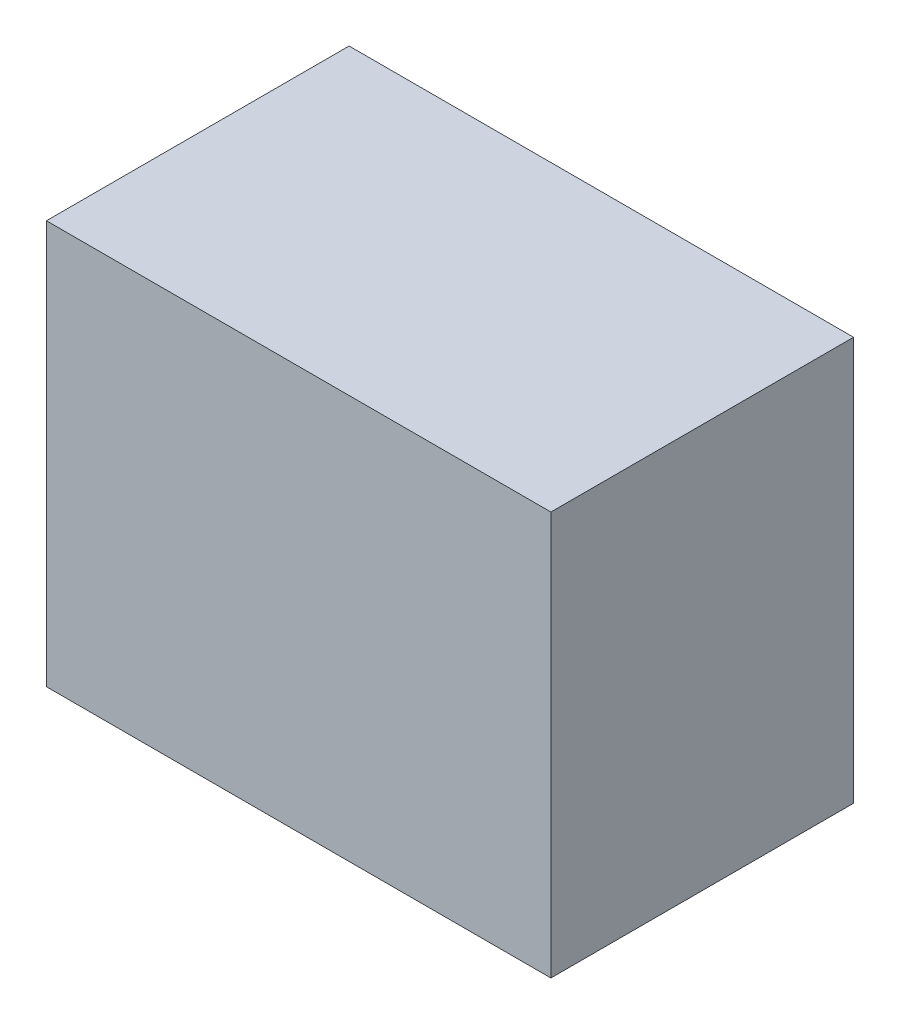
ISO-10303-21;
HEADER;
FILE_DESCRIPTION(('STEP AP214'),'2;1');
FILE_NAME('part.step','',(''),(''),'','','');
FILE_SCHEMA(('AUTOMOTIVE_DESIGN { 1 0 10303 214 1 1 1 1 }'));
ENDSEC;
DATA;
#1=APPLICATION_CONTEXT('core data for automotive mechanical design processes');
#2=APPLICATION_PROTOCOL_DEFINITION('international standard','automotive_design',2000,#1);
#3=PRODUCT_CONTEXT('',#1,'mechanical');
#4=PRODUCT('Part','Part','',(#3));
#5=PRODUCT_RELATED_PRODUCT_CATEGORY('part','',(#4));
#6=PRODUCT_DEFINITION_FORMATION('','',#4);
#7=PRODUCT_DEFINITION_CONTEXT('part definition',#1,'design');
#8=PRODUCT_DEFINITION('design','',#6,#7);
#9=PRODUCT_DEFINITION_SHAPE('','',#8);
#10=(LENGTH_UNIT() NAMED_UNIT(*) SI_UNIT(.MILLI.,.METRE.));
#11=(NAMED_UNIT(*) PLANE_ANGLE_UNIT() SI_UNIT($,.RADIAN.));
#12=(NAMED_UNIT(*) SI_UNIT($,.STERADIAN.) SOLID_ANGLE_UNIT());
#13=UNCERTAINTY_MEASURE_WITH_UNIT(LENGTH_MEASURE(1.E-05),#10,'distance_accuracy_value','');
#14=(GEOMETRIC_REPRESENTATION_CONTEXT(3) GLOBAL_UNCERTAINTY_ASSIGNED_CONTEXT((#13)) GLOBAL_UNIT_ASSIGNED_CONTEXT((#10,
#11,#12)) REPRESENTATION_CONTEXT('',''));
#15=CARTESIAN_POINT('',(0.,0.,0.));
#16=DIRECTION('',(0.,0.,1.));
#17=DIRECTION('',(1.,0.,0.));
#18=AXIS2_PLACEMENT_3D('',#15,#16,#17);
#19=CARTESIAN_POINT('',(-0.635,-0.508,0.762));
#20=DIRECTION('',(0.,0.,1.));
#21=DIRECTION('',(1.,0.,0.));
#22=AXIS2_PLACEMENT_3D('',#19,#20,#21);
#23=PLANE('',#22);
#24=DIRECTION('',(1.,0.,0.));
#25=VECTOR('',#24,1.);
#26=CARTESIAN_POINT('',(-0.635,0.508,0.762));
#27=LINE('',#26,#25);
#28=CARTESIAN_POINT('',(-0.635,0.508,0.762));
#29=VERTEX_POINT('',#28);
#30=CARTESIAN_POINT('',(0.635,0.508,0.762));
#31=VERTEX_POINT('',#30);
#32=EDGE_CURVE('E53',#29,#31,#27,.T.);
#33=ORIENTED_EDGE('',*,*,#32,.F.);
#34=DIRECTION('',(0.,1.,0.));
#35=VECTOR('',#34,1.);
#36=CARTESIAN_POINT('',(-0.635,-0.508,0.762));
#37=LINE('',#36,#35);
#38=CARTESIAN_POINT('',(-0.635,-0.508,0.762));
#39=VERTEX_POINT('',#38);
#40=EDGE_CURVE('E68',#39,#29,#37,.T.);
#41=ORIENTED_EDGE('',*,*,#40,.F.);
#42=DIRECTION('',(1.,0.,0.));
#43=VECTOR('',#42,1.);
#44=CARTESIAN_POINT('',(0.635,-0.508,0.762));
#45=LINE('',#44,#43);
#46=CARTESIAN_POINT('',(0.635,-0.508,0.762));
#47=VERTEX_POINT('',#46);
#48=EDGE_CURVE('E20',#47,#39,#45,.F.);
#49=ORIENTED_EDGE('',*,*,#48,.F.);
#50=DIRECTION('',(0.,1.,0.));
#51=VECTOR('',#50,1.);
#52=CARTESIAN_POINT('',(0.635,0.508,0.762));
#53=LINE('',#52,#51);
#54=EDGE_CURVE('E58',#31,#47,#53,.F.);
#55=ORIENTED_EDGE('',*,*,#54,.F.);
#56=EDGE_LOOP('',(#33,#41,#49,#55));
#57=FACE_BOUND('',#56,.T.);
#58=ADVANCED_FACE('F17',(#57),#23,.T.);
#59=CARTESIAN_POINT('',(0.635,-0.508,0.));
#60=DIRECTION('',(0.,-1.,0.));
#61=DIRECTION('',(0.,0.,-1.));
#62=AXIS2_PLACEMENT_3D('',#59,#60,#61);
#63=PLANE('',#62);
#64=DIRECTION('',(0.,0.,1.));
#65=VECTOR('',#64,1.);
#66=CARTESIAN_POINT('',(-0.635,-0.508,0.));
#67=LINE('',#66,#65);
#68=CARTESIAN_POINT('',(-0.635,-0.508,0.));
#69=VERTEX_POINT('',#68);
#70=EDGE_CURVE('E79',#69,#39,#67,.T.);
#71=ORIENTED_EDGE('',*,*,#70,.F.);
#72=DIRECTION('',(1.,0.,0.));
#73=VECTOR('',#72,1.);
#74=CARTESIAN_POINT('',(-0.635,-0.508,0.));
#75=LINE('',#74,#73);
#76=CARTESIAN_POINT('',(0.635,-0.508,0.));
#77=VERTEX_POINT('',#76);
#78=EDGE_CURVE('E74',#69,#77,#75,.T.);
#79=ORIENTED_EDGE('',*,*,#78,.T.);
#80=DIRECTION('',(0.,0.,-1.));
#81=VECTOR('',#80,1.);
#82=CARTESIAN_POINT('',(0.635,-0.508,0.));
#83=LINE('',#82,#81);
#84=EDGE_CURVE('E63',#47,#77,#83,.T.);
#85=ORIENTED_EDGE('',*,*,#84,.F.);
#86=ORIENTED_EDGE('',*,*,#48,.T.);
#87=EDGE_LOOP('',(#71,#79,#85,#86));
#88=FACE_BOUND('',#87,.T.);
#89=ADVANCED_FACE('F73',(#88),#63,.T.);
#90=CARTESIAN_POINT('',(0.635,0.508,0.));
#91=DIRECTION('',(1.,0.,0.));
#92=DIRECTION('',(0.,0.,-1.));
#93=AXIS2_PLACEMENT_3D('',#90,#91,#92);
#94=PLANE('',#93);
#95=ORIENTED_EDGE('',*,*,#84,.T.);
#96=DIRECTION('',(0.,1.,0.));
#97=VECTOR('',#96,1.);
#98=CARTESIAN_POINT('',(0.635,-0.508,0.));
#99=LINE('',#98,#97);
#100=CARTESIAN_POINT('',(0.635,0.508,0.));
#101=VERTEX_POINT('',#100);
#102=EDGE_CURVE('E84',#77,#101,#99,.T.);
#103=ORIENTED_EDGE('',*,*,#102,.T.);
#104=DIRECTION('',(0.,0.,1.));
#105=VECTOR('',#104,1.);
#106=CARTESIAN_POINT('',(0.635,0.508,0.));
#107=LINE('',#106,#105);
#108=EDGE_CURVE('E65',#31,#101,#107,.F.);
#109=ORIENTED_EDGE('',*,*,#108,.F.);
#110=ORIENTED_EDGE('',*,*,#54,.T.);
#111=EDGE_LOOP('',(#95,#103,#109,#110));
#112=FACE_BOUND('',#111,.T.);
#113=ADVANCED_FACE('F60',(#112),#94,.T.);
#114=CARTESIAN_POINT('',(-0.635,0.508,0.));
#115=DIRECTION('',(0.,1.,0.));
#116=DIRECTION('',(0.,0.,1.));
#117=AXIS2_PLACEMENT_3D('',#114,#115,#116);
#118=PLANE('',#117);
#119=ORIENTED_EDGE('',*,*,#108,.T.);
#120=DIRECTION('',(1.,0.,0.));
#121=VECTOR('',#120,1.);
#122=CARTESIAN_POINT('',(-0.635,0.508,0.));
#123=LINE('',#122,#121);
#124=CARTESIAN_POINT('',(-0.635,0.508,0.));
#125=VERTEX_POINT('',#124);
#126=EDGE_CURVE('E26',#101,#125,#123,.F.);
#127=ORIENTED_EDGE('',*,*,#126,.T.);
#128=DIRECTION('',(0.,0.,1.));
#129=VECTOR('',#128,1.);
#130=CARTESIAN_POINT('',(-0.635,0.508,0.));
#131=LINE('',#130,#129);
#132=EDGE_CURVE('E34',#29,#125,#131,.F.);
#133=ORIENTED_EDGE('',*,*,#132,.F.);
#134=ORIENTED_EDGE('',*,*,#32,.T.);
#135=EDGE_LOOP('',(#119,#127,#133,#134));
#136=FACE_BOUND('',#135,.T.);
#137=ADVANCED_FACE('F88',(#136),#118,.T.);
#138=CARTESIAN_POINT('',(-0.635,-0.508,0.));
#139=DIRECTION('',(-1.,0.,0.));
#140=DIRECTION('',(0.,0.,1.));
#141=AXIS2_PLACEMENT_3D('',#138,#139,#140);
#142=PLANE('',#141);
#143=ORIENTED_EDGE('',*,*,#132,.T.);
#144=DIRECTION('',(0.,1.,0.));
#145=VECTOR('',#144,1.);
#146=CARTESIAN_POINT('',(-0.635,-0.508,0.));
#147=LINE('',#146,#145);
#148=EDGE_CURVE('E11',#125,#69,#147,.F.);
#149=ORIENTED_EDGE('',*,*,#148,.T.);
#150=ORIENTED_EDGE('',*,*,#70,.T.);
#151=ORIENTED_EDGE('',*,*,#40,.T.);
#152=EDGE_LOOP('',(#143,#149,#150,#151));
#153=FACE_BOUND('',#152,.T.);
#154=ADVANCED_FACE('F91',(#153),#142,.T.);
#155=CARTESIAN_POINT('',(-0.635,-0.508,0.));
#156=DIRECTION('',(0.,0.,1.));
#157=DIRECTION('',(1.,0.,0.));
#158=AXIS2_PLACEMENT_3D('',#155,#156,#157);
#159=PLANE('',#158);
#160=ORIENTED_EDGE('',*,*,#126,.F.);
#161=ORIENTED_EDGE('',*,*,#102,.F.);
#162=ORIENTED_EDGE('',*,*,#78,.F.);
#163=ORIENTED_EDGE('',*,*,#148,.F.);
#164=EDGE_LOOP('',(#160,#161,#162,#163));
#165=FACE_BOUND('',#164,.T.);
#166=ADVANCED_FACE('F90',(#165),#159,.F.);
#167=CLOSED_SHELL('',(#58,#89,#113,#137,#154,#166));
#168=MANIFOLD_SOLID_BREP('B1',#167);
#169=ADVANCED_BREP_SHAPE_REPRESENTATION('',(#18,#168),#14);
#170=SHAPE_DEFINITION_REPRESENTATION(#9,#169);
ENDSEC;
END-ISO-10303-21;
